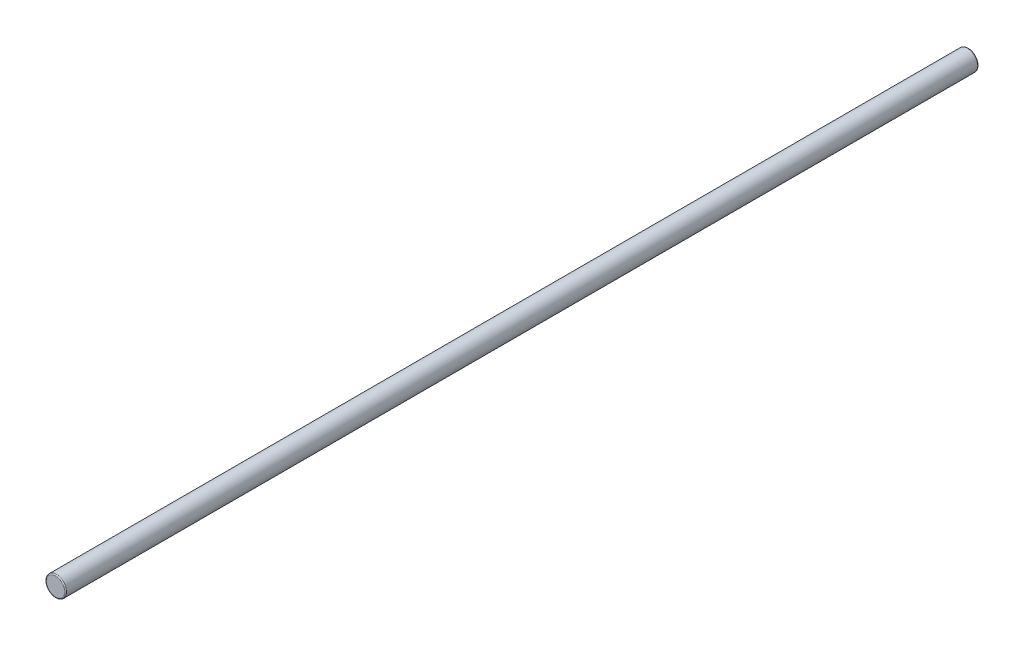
ISO-10303-21;
HEADER;
FILE_DESCRIPTION(('STEP AP214'),'2;1');
FILE_NAME('part.step','',(''),(''),'','','');
FILE_SCHEMA(('AUTOMOTIVE_DESIGN { 1 0 10303 214 1 1 1 1 }'));
ENDSEC;
DATA;
#1=APPLICATION_CONTEXT('core data for automotive mechanical design processes');
#2=APPLICATION_PROTOCOL_DEFINITION('international standard','automotive_design',2000,#1);
#3=PRODUCT_CONTEXT('',#1,'mechanical');
#4=PRODUCT('Part','Part','',(#3));
#5=PRODUCT_RELATED_PRODUCT_CATEGORY('part','',(#4));
#6=PRODUCT_DEFINITION_FORMATION('','',#4);
#7=PRODUCT_DEFINITION_CONTEXT('part definition',#1,'design');
#8=PRODUCT_DEFINITION('design','',#6,#7);
#9=PRODUCT_DEFINITION_SHAPE('','',#8);
#10=(LENGTH_UNIT() NAMED_UNIT(*) SI_UNIT(.MILLI.,.METRE.));
#11=(NAMED_UNIT(*) PLANE_ANGLE_UNIT() SI_UNIT($,.RADIAN.));
#12=(NAMED_UNIT(*) SI_UNIT($,.STERADIAN.) SOLID_ANGLE_UNIT());
#13=UNCERTAINTY_MEASURE_WITH_UNIT(LENGTH_MEASURE(1.E-05),#10,'distance_accuracy_value','');
#14=(GEOMETRIC_REPRESENTATION_CONTEXT(3) GLOBAL_UNCERTAINTY_ASSIGNED_CONTEXT((#13)) GLOBAL_UNIT_ASSIGNED_CONTEXT((#10,
#11,#12)) REPRESENTATION_CONTEXT('',''));
#15=CARTESIAN_POINT('',(0.,0.,0.));
#16=DIRECTION('',(0.,0.,1.));
#17=DIRECTION('',(1.,0.,0.));
#18=AXIS2_PLACEMENT_3D('',#15,#16,#17);
#19=CARTESIAN_POINT('',(0.,0.,900.));
#20=DIRECTION('',(0.,0.,-1.));
#21=DIRECTION('',(-1.,0.,0.));
#22=AXIS2_PLACEMENT_3D('',#19,#20,#21);
#23=CYLINDRICAL_SURFACE('',#22,10.);
#24=CARTESIAN_POINT('',(0.,0.,1.));
#25=DIRECTION('',(0.,0.,1.));
#26=DIRECTION('',(1.,0.,0.));
#27=AXIS2_PLACEMENT_3D('',#24,#25,#26);
#28=CIRCLE('',#27,10.);
#29=CARTESIAN_POINT('',(10.,0.,1.));
#30=VERTEX_POINT('',#29);
#31=EDGE_CURVE('E36',#30,#30,#28,.T.);
#32=ORIENTED_EDGE('',*,*,#31,.T.);
#33=EDGE_LOOP('',(#32));
#34=FACE_BOUND('',#33,.T.);
#35=CARTESIAN_POINT('',(0.,0.,899.));
#36=DIRECTION('',(0.,0.,1.));
#37=DIRECTION('',(1.,0.,0.));
#38=AXIS2_PLACEMENT_3D('',#35,#36,#37);
#39=CIRCLE('',#38,10.);
#40=CARTESIAN_POINT('',(10.,0.,899.));
#41=VERTEX_POINT('',#40);
#42=EDGE_CURVE('E40',#41,#41,#39,.F.);
#43=ORIENTED_EDGE('',*,*,#42,.T.);
#44=EDGE_LOOP('',(#43));
#45=FACE_BOUND('',#44,.T.);
#46=ADVANCED_FACE('F30',(#34,#45),#23,.T.);
#47=CARTESIAN_POINT('',(0.,0.,900.));
#48=DIRECTION('',(0.,0.,1.));
#49=DIRECTION('',(1.,0.,0.));
#50=AXIS2_PLACEMENT_3D('',#47,#48,#49);
#51=PLANE('',#50);
#52=CARTESIAN_POINT('',(0.,0.,900.));
#53=DIRECTION('',(0.,0.,1.));
#54=DIRECTION('',(1.,0.,0.));
#55=AXIS2_PLACEMENT_3D('',#52,#53,#54);
#56=CIRCLE('',#55,9.);
#57=CARTESIAN_POINT('',(9.,0.,900.));
#58=VERTEX_POINT('',#57);
#59=EDGE_CURVE('E44',#58,#58,#56,.T.);
#60=ORIENTED_EDGE('',*,*,#59,.T.);
#61=EDGE_LOOP('',(#60));
#62=FACE_BOUND('',#61,.T.);
#63=ADVANCED_FACE('F50',(#62),#51,.T.);
#64=CARTESIAN_POINT('',(0.,0.,0.));
#65=DIRECTION('',(0.,0.,1.));
#66=DIRECTION('',(1.,0.,0.));
#67=AXIS2_PLACEMENT_3D('',#64,#65,#66);
#68=PLANE('',#67);
#69=CARTESIAN_POINT('',(0.,0.,0.));
#70=DIRECTION('',(0.,0.,1.));
#71=DIRECTION('',(1.,0.,0.));
#72=AXIS2_PLACEMENT_3D('',#69,#70,#71);
#73=CIRCLE('',#72,9.);
#74=CARTESIAN_POINT('',(9.,0.,0.));
#75=VERTEX_POINT('',#74);
#76=EDGE_CURVE('E10',#75,#75,#73,.F.);
#77=ORIENTED_EDGE('',*,*,#76,.T.);
#78=EDGE_LOOP('',(#77));
#79=FACE_BOUND('',#78,.T.);
#80=ADVANCED_FACE('F55',(#79),#68,.F.);
#81=CARTESIAN_POINT('',(0.,0.,899.));
#82=DIRECTION('',(0.,0.,1.));
#83=DIRECTION('',(1.,0.,0.));
#84=AXIS2_PLACEMENT_3D('',#81,#82,#83);
#85=TOROIDAL_SURFACE('',#84,9.,1.);
#86=ORIENTED_EDGE('',*,*,#42,.F.);
#87=EDGE_LOOP('',(#86));
#88=FACE_BOUND('',#87,.T.);
#89=ORIENTED_EDGE('',*,*,#59,.F.);
#90=EDGE_LOOP('',(#89));
#91=FACE_BOUND('',#90,.T.);
#92=ADVANCED_FACE('F52',(#88,#91),#85,.T.);
#93=CARTESIAN_POINT('',(0.,0.,1.));
#94=DIRECTION('',(0.,0.,1.));
#95=DIRECTION('',(1.,0.,0.));
#96=AXIS2_PLACEMENT_3D('',#93,#94,#95);
#97=TOROIDAL_SURFACE('',#96,9.,1.);
#98=ORIENTED_EDGE('',*,*,#76,.F.);
#99=EDGE_LOOP('',(#98));
#100=FACE_BOUND('',#99,.T.);
#101=ORIENTED_EDGE('',*,*,#31,.F.);
#102=EDGE_LOOP('',(#101));
#103=FACE_BOUND('',#102,.T.);
#104=ADVANCED_FACE('F54',(#100,#103),#97,.T.);
#105=CLOSED_SHELL('',(#46,#63,#80,#92,#104));
#106=MANIFOLD_SOLID_BREP('B2',#105);
#107=ADVANCED_BREP_SHAPE_REPRESENTATION('',(#18,#106),#14);
#108=SHAPE_DEFINITION_REPRESENTATION(#9,#107);
ENDSEC;
END-ISO-10303-21;
